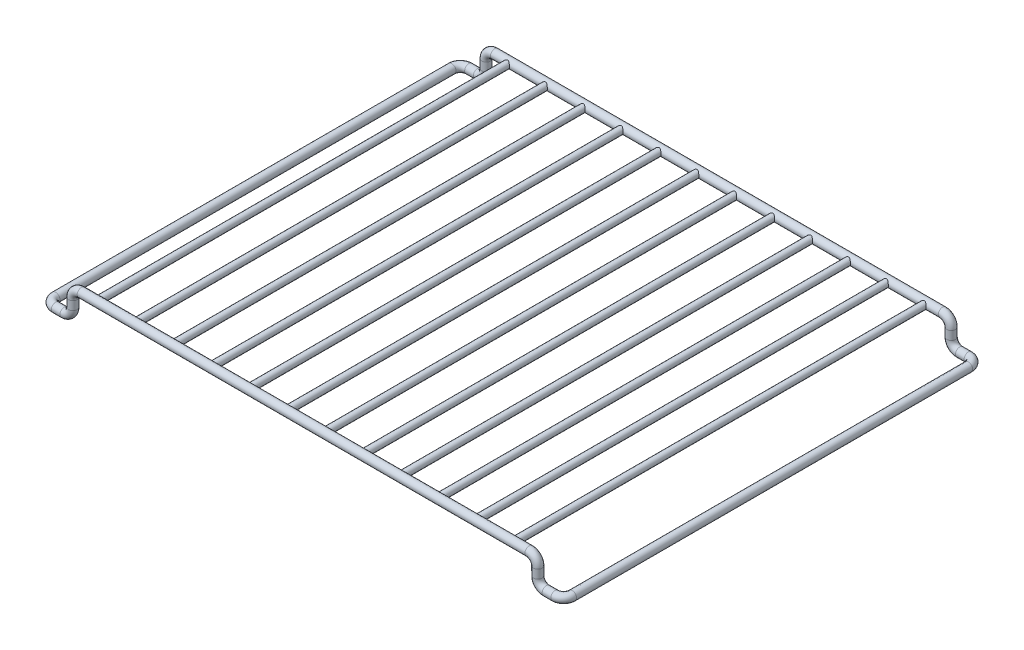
from build123d import *

# Parameters (mm, degrees)
SKETCH1_R           = 2.5
EXTRUDE1_REACH      = 289
EXTRUDE1_END_RADIUS = 2.5
SKETCH2_R           = 2
LPATTERN1_COUNT     = 6
LPATTERN1_PITCH     = 22


with BuildPart() as part:
    # Sweep1: sweep along a curve in space
    with BuildLine() as sweep1_path:
        Line((0, 0, 0), (130, 0, 0))
        ThreePointArc((130, 0, 0), (133.535533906, -1.464466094, 0), (135, -5, 0))
        Line((135, -5, 0), (135, -10, 0))
        ThreePointArc((135, -10, 0), (136.464466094, -13.535533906, 0), (140, -15, 0))
        Line((140, -15, 0), (145, -15, 0))
        ThreePointArc((145, -15, 0), (148.535533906, -15, -1.464466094), (150, -15, -5))
        Line((150, -15, -5), (150, -15, -235))
        ThreePointArc((150, -15, -235), (148.535533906, -15, -238.535533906), (145, -15, -240))
        Line((145, -15, -240), (140, -15, -240))
        ThreePointArc((140, -15, -240), (136.464466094, -13.535533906, -240), (135, -10, -240))
        Line((135, -10, -240), (135, -5, -240))
        ThreePointArc((135, -5, -240), (133.535533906, -1.464466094, -240), (130, 0, -240))
        Line((130, 0, -240), (0, 0, -240))
    # Sketch1 → Sweep1 (sweep)
    with BuildSketch(Plane(origin=(0, 0, 0), x_dir=(0, 0, -1), z_dir=(1, 0, 0))):
        Circle(SKETCH1_R)
    sweep(path=sweep1_path.line)

    # Extrude1: up to this cylinder (the profile starts outside it)
    extrude1_end = Plane(origin=(11, 0, -240), z_dir=(-1, 0, 0)) * Cylinder(EXTRUDE1_END_RADIUS, 584, mode=Mode.PRIVATE)
    # Sketch2 → Extrude1 (add, up to the surface)
    with BuildSketch(Plane.XY, mode=Mode.PRIVATE) as extrude1_sk1:
        with Locations((11, 0)):
            Circle(SKETCH2_R)
    extrude1_tool1 = extrude(extrude1_sk1.sketch, amount=-EXTRUDE1_REACH, mode=Mode.PRIVATE) - extrude1_end
    extrude1 = extrude1_tool1.solids().sort_by_distance((11, 0, 0))[0]
    add(extrude1)

    # LPattern1: Extrude1 ×6
    with Locations(*[(i * LPATTERN1_PITCH, 0, 0) for i in range(1, LPATTERN1_COUNT)]):
        add(extrude1)

    # Mirror1: part across plane


with BuildPart() as part_1:
    add(part.part)
    add(part.part.mirror(Plane(origin=(0, 0, 0), x_dir=(0, 0, 1), z_dir=(1, 0, 0))))


solid = part_1.part
